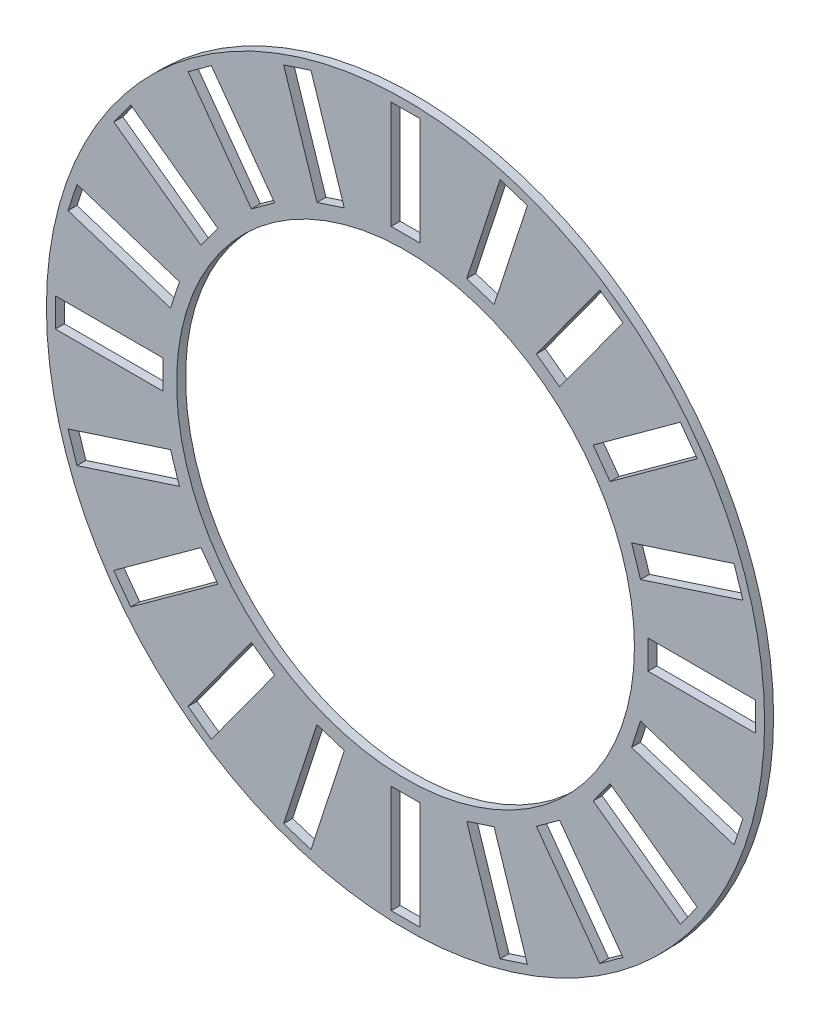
from build123d import *

# Parameters (mm, degrees)
ESQUISSE1_R                  = 20
ESQUISSE1_R_2                = 12.75
BASE_EXTRUSION_DEPTH         = 0.25
ESQUISSE2_W                  = 6
ESQUISSE2_H                  = 1.6
ENCOCHE_DEPTH                = 29.28869032
R_P_TITION_CIRCULAIRE1_COUNT = 20


with BuildPart() as part:
    # Esquisse1 → Base-Extrusion (new, symmetric)
    with BuildSketch(Plane.XY):
        Circle(ESQUISSE1_R)
        Circle(ESQUISSE1_R_2, mode=Mode.SUBTRACT)
    extrude(amount=BASE_EXTRUSION_DEPTH, both=True)

    # Esquisse2 → encoche (cut, through all)
    with BuildSketch(Plane.XY.offset(0.25)):
        with Locations((16.5, 0)):
            Rectangle(ESQUISSE2_W, ESQUISSE2_H)
    encoche = extrude(amount=-ENCOCHE_DEPTH, mode=Mode.SUBTRACT)

    # R_p_tition circulaire1: encoche ×20 about axis
    r_p_tition_circulaire1_axis = Axis((0, 0, 2.551730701), (0, 0, -1))
    for i in range(1, R_P_TITION_CIRCULAIRE1_COUNT):
        add(encoche.rotate(r_p_tition_circulaire1_axis, i * 360 / R_P_TITION_CIRCULAIRE1_COUNT), mode=Mode.SUBTRACT)


solid = part.part
